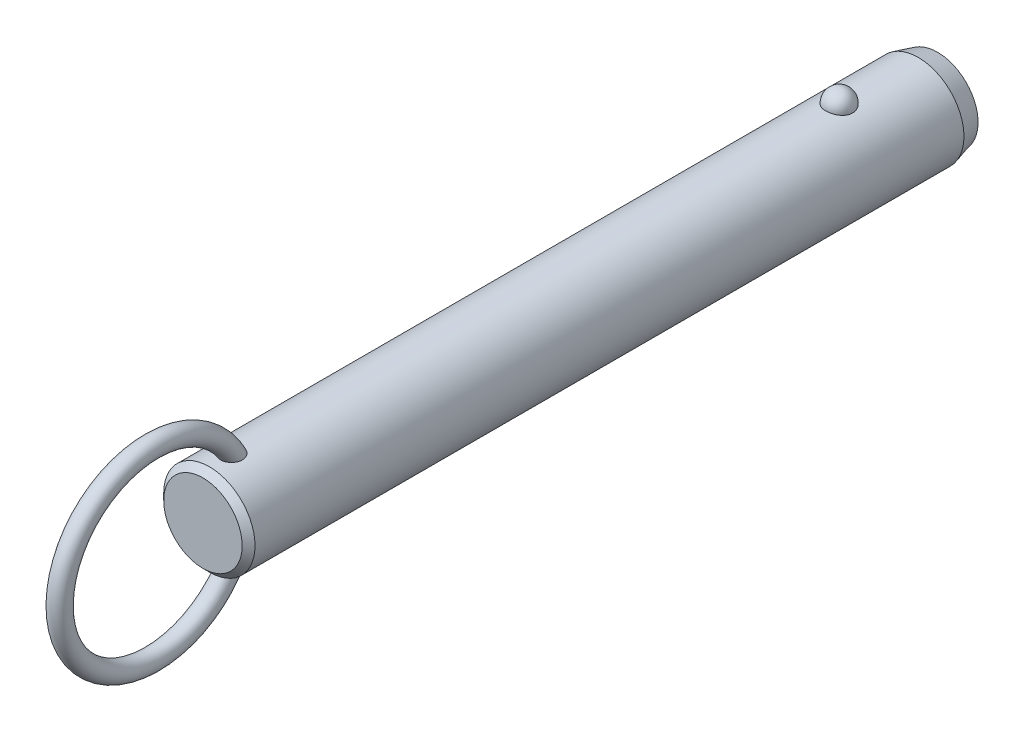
ISO-10303-21;
HEADER;
FILE_DESCRIPTION(('STEP AP214'),'2;1');
FILE_NAME('part.step','',(''),(''),'','','');
FILE_SCHEMA(('AUTOMOTIVE_DESIGN { 1 0 10303 214 1 1 1 1 }'));
ENDSEC;
DATA;
#1=APPLICATION_CONTEXT('core data for automotive mechanical design processes');
#2=APPLICATION_PROTOCOL_DEFINITION('international standard','automotive_design',2000,#1);
#3=PRODUCT_CONTEXT('',#1,'mechanical');
#4=PRODUCT('Part','Part','',(#3));
#5=PRODUCT_RELATED_PRODUCT_CATEGORY('part','',(#4));
#6=PRODUCT_DEFINITION_FORMATION('','',#4);
#7=PRODUCT_DEFINITION_CONTEXT('part definition',#1,'design');
#8=PRODUCT_DEFINITION('design','',#6,#7);
#9=PRODUCT_DEFINITION_SHAPE('','',#8);
#10=(LENGTH_UNIT() NAMED_UNIT(*) SI_UNIT(.MILLI.,.METRE.));
#11=(NAMED_UNIT(*) PLANE_ANGLE_UNIT() SI_UNIT($,.RADIAN.));
#12=(NAMED_UNIT(*) SI_UNIT($,.STERADIAN.) SOLID_ANGLE_UNIT());
#13=UNCERTAINTY_MEASURE_WITH_UNIT(LENGTH_MEASURE(1.E-05),#10,'distance_accuracy_value','');
#14=(GEOMETRIC_REPRESENTATION_CONTEXT(3) GLOBAL_UNCERTAINTY_ASSIGNED_CONTEXT((#13)) GLOBAL_UNIT_ASSIGNED_CONTEXT((#10,
#11,#12)) REPRESENTATION_CONTEXT('',''));
#15=CARTESIAN_POINT('',(0.,0.,0.));
#16=DIRECTION('',(0.,0.,1.));
#17=DIRECTION('',(1.,0.,0.));
#18=AXIS2_PLACEMENT_3D('',#15,#16,#17);
#19=CARTESIAN_POINT('',(0.,0.,88.9));
#20=DIRECTION('',(0.,0.,-1.));
#21=DIRECTION('',(-1.,0.,0.));
#22=AXIS2_PLACEMENT_3D('',#19,#20,#21);
#23=CYLINDRICAL_SURFACE('',#22,7.1);
#24=CARTESIAN_POINT('',(2.0769088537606,6.78943661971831,-2.1));
#25=CARTESIAN_POINT('',(2.07690739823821,6.78943796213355,-1.98268154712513));
#26=CARTESIAN_POINT('',(2.06738130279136,6.79237331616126,-1.86534506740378));
#27=CARTESIAN_POINT('',(2.0295040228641,6.8037853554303,-1.63400788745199));
#28=CARTESIAN_POINT('',(2.00114757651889,6.81226358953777,-1.52000812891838));
#29=CARTESIAN_POINT('',(1.92632025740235,6.83379798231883,-1.29863433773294));
#30=CARTESIAN_POINT('',(1.87985726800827,6.84685214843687,-1.19125744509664));
#31=CARTESIAN_POINT('',(1.76995205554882,6.87608091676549,-0.98604657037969));
#32=CARTESIAN_POINT('',(1.70650980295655,6.8922555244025,-0.88821260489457));
#33=CARTESIAN_POINT('',(1.5638119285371,6.92602930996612,-0.704242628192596));
#34=CARTESIAN_POINT('',(1.4844714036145,6.94363582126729,-0.618173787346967));
#35=CARTESIAN_POINT('',(1.31221746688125,6.97823658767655,-0.460740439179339));
#36=CARTESIAN_POINT('',(1.21930409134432,6.99523084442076,-0.389375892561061));
#37=CARTESIAN_POINT('',(1.02268781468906,7.02666176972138,-0.263547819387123));
#38=CARTESIAN_POINT('',(0.91902009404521,7.04110638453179,-0.209031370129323));
#39=CARTESIAN_POINT('',(0.703548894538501,7.06588726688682,-0.118163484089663));
#40=CARTESIAN_POINT('',(0.591746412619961,7.07622403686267,-0.0818098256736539));
#41=CARTESIAN_POINT('',(0.365557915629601,7.09147068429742,-0.0288711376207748));
#42=CARTESIAN_POINT('',(0.251267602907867,7.09648447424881,-0.0119070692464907));
#43=CARTESIAN_POINT('',(0.0213499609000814,7.10089837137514,0.00304925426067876));
#44=CARTESIAN_POINT('',(-0.0942772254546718,7.10029907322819,0.00104351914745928));
#45=CARTESIAN_POINT('',(-0.321651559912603,7.09360829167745,-0.0216931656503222));
#46=CARTESIAN_POINT('',(-0.433431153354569,7.08760388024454,-0.0421272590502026));
#47=CARTESIAN_POINT('',(-0.651862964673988,7.07086131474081,-0.100729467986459));
#48=CARTESIAN_POINT('',(-0.758515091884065,7.06012307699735,-0.138897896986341));
#49=CARTESIAN_POINT('',(-0.964449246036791,7.03496097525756,-0.232213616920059));
#50=CARTESIAN_POINT('',(-1.06368095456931,7.02051445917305,-0.287465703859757));
#51=CARTESIAN_POINT('',(-1.25145353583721,6.98948740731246,-0.413383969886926));
#52=CARTESIAN_POINT('',(-1.33999321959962,6.97290663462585,-0.48405186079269));
#53=CARTESIAN_POINT('',(-1.50591604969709,6.93898770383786,-0.640594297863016));
#54=CARTESIAN_POINT('',(-1.58302488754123,6.92164094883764,-0.726757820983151));
#55=CARTESIAN_POINT('',(-1.72189320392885,6.8884103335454,-0.91092752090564));
#56=CARTESIAN_POINT('',(-1.78365144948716,6.87252659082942,-1.008934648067));
#57=CARTESIAN_POINT('',(-1.89101272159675,6.84377189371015,-1.21549497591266));
#58=CARTESIAN_POINT('',(-1.93639553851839,6.83094274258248,-1.32416860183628));
#59=CARTESIAN_POINT('',(-2.00874275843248,6.81002070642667,-1.54791500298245));
#60=CARTESIAN_POINT('',(-2.03570774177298,6.80192767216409,-1.66298757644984));
#61=CARTESIAN_POINT('',(-2.07047276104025,6.7914266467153,-1.89571453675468));
#62=CARTESIAN_POINT('',(-2.07835878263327,6.78899315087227,-2.01335491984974));
#63=CARTESIAN_POINT('',(-2.07502083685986,6.79001409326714,-2.24833570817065));
#64=CARTESIAN_POINT('',(-2.06379746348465,6.7934683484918,-2.36567612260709));
#65=CARTESIAN_POINT('',(-2.02263913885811,6.80583442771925,-2.59603194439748));
#66=CARTESIAN_POINT('',(-1.99281127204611,6.81471501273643,-2.70906820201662));
#67=CARTESIAN_POINT('',(-1.91526639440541,6.83691232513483,-2.92836575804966));
#68=CARTESIAN_POINT('',(-1.8675486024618,6.85022924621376,-3.03462676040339));
#69=CARTESIAN_POINT('',(-1.75504492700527,6.87991336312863,-3.23806487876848));
#70=CARTESIAN_POINT('',(-1.69015924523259,6.89629822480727,-3.33518422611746));
#71=CARTESIAN_POINT('',(-1.54505404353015,6.93024852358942,-3.51697105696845));
#72=CARTESIAN_POINT('',(-1.46483385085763,6.94781401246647,-3.60163799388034));
#73=CARTESIAN_POINT('',(-1.29071406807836,6.98225977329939,-3.75654119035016));
#74=CARTESIAN_POINT('',(-1.19675650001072,6.99913673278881,-3.82671308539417));
#75=CARTESIAN_POINT('',(-0.997940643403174,7.03023618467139,-3.9501837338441));
#76=CARTESIAN_POINT('',(-0.89308318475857,7.04445887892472,-4.00348377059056));
#77=CARTESIAN_POINT('',(-0.676902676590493,7.06848365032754,-4.09107242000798));
#78=CARTESIAN_POINT('',(-0.565686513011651,7.0783430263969,-4.12560889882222));
#79=CARTESIAN_POINT('',(-0.338739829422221,7.09282534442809,-4.17575450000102));
#80=CARTESIAN_POINT('',(-0.223009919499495,7.09744899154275,-4.19136617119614));
#81=CARTESIAN_POINT('',(0.00707628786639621,7.10090930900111,-4.20307965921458));
#82=CARTESIAN_POINT('',(0.121410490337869,7.09986531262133,-4.19958377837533));
#83=CARTESIAN_POINT('',(0.347815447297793,7.092380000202,-4.17411564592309));
#84=CARTESIAN_POINT('',(0.459886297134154,7.08593891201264,-4.15214417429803));
#85=CARTESIAN_POINT('',(0.678084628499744,7.06838983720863,-4.09049562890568));
#86=CARTESIAN_POINT('',(0.784237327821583,7.05730369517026,-4.05090137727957));
#87=CARTESIAN_POINT('',(0.988305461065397,7.03163139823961,-3.95511447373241));
#88=CARTESIAN_POINT('',(1.08622031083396,7.01704499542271,-3.89892064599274));
#89=CARTESIAN_POINT('',(1.27284490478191,6.98562668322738,-3.77035541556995));
#90=CARTESIAN_POINT('',(1.36137372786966,6.96876135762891,-3.69772964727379));
#91=CARTESIAN_POINT('',(1.52509486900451,6.93477412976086,-3.53878279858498));
#92=CARTESIAN_POINT('',(1.60028496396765,6.91765218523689,-3.45245943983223));
#93=CARTESIAN_POINT('',(1.73681688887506,6.88465753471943,-3.26658774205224));
#94=CARTESIAN_POINT('',(1.79785966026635,6.86881574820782,-3.16681408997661));
#95=CARTESIAN_POINT('',(1.90265327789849,6.84053157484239,-2.95814408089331));
#96=CARTESIAN_POINT('',(1.94640861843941,6.82808830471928,-2.84925010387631));
#97=CARTESIAN_POINT('',(2.01274378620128,6.80881460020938,-2.63454318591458));
#98=CARTESIAN_POINT('',(2.03676193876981,6.80160856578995,-2.52920574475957));
#99=CARTESIAN_POINT('',(2.06884490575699,6.79191902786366,-2.3159172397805));
#100=CARTESIAN_POINT('',(2.07691019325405,6.78943538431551,-2.20796625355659));
#101=CARTESIAN_POINT('',(2.0769088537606,6.78943661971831,-2.1));
#102=B_SPLINE_CURVE_WITH_KNOTS('',3,(#24,#25,#26,#27,#28,#29,#30,#31,#32,#33,#34,#35,#36,#37,
#38,#39,#40,#41,#42,#43,#44,#45,#46,#47,#48,#49,#50,#51,#52,#53,#54,#55,#56,#57,#58,#59,#60,#61,
#62,#63,#64,#65,#66,#67,#68,#69,#70,#71,#72,#73,#74,#75,#76,#77,#78,#79,#80,#81,#82,#83,#84,#85,
#86,#87,#88,#89,#90,#91,#92,#93,#94,#95,#96,#97,#98,#99,#100,#101),.UNSPECIFIED.,.T.,.F.,(4,2,2,
2,2,2,2,2,2,2,2,2,2,2,2,2,2,2,2,2,2,2,2,2,2,2,2,2,2,2,2,2,2,2,2,2,2,2,4),(0.,0.351568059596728,
0.703234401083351,1.05474780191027,1.40626181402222,1.75970563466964,2.11314851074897,
2.4654696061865,2.81774759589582,3.16301449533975,3.50824481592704,3.84801136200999,
4.18778391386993,4.52968352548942,4.87162112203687,5.22076181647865,5.56993054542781,
5.92363364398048,6.27732559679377,6.62942052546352,6.98150450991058,7.33158042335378,
7.68167162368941,8.03384443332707,8.38603269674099,8.73975272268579,9.09344583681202,
9.44234545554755,9.79119807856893,10.1327344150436,10.4742563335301,10.8141898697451,
11.1541474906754,11.4997793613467,11.8454687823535,12.1979079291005,12.5502553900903,
12.8738073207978,13.1973496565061),.UNSPECIFIED.);
#103=CARTESIAN_POINT('',(2.0769088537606,6.78943661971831,-2.1));
#104=VERTEX_POINT('',#103);
#105=EDGE_CURVE('E41',#104,#104,#102,.T.);
#106=ORIENTED_EDGE('',*,*,#105,.T.);
#107=EDGE_LOOP('',(#106));
#108=FACE_BOUND('',#107,.T.);
#109=CARTESIAN_POINT('',(0.,0.,95.82));
#110=DIRECTION('',(0.,0.,1.));
#111=DIRECTION('',(1.,0.,0.));
#112=AXIS2_PLACEMENT_3D('',#109,#110,#111);
#113=CIRCLE('',#112,7.1);
#114=CARTESIAN_POINT('',(7.1,0.,95.82));
#115=VERTEX_POINT('',#114);
#116=EDGE_CURVE('E10',#115,#115,#113,.F.);
#117=ORIENTED_EDGE('',*,*,#116,.T.);
#118=EDGE_LOOP('',(#117));
#119=FACE_BOUND('',#118,.T.);
#120=CARTESIAN_POINT('',(-0.429539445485,-7.08699541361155,90.6429212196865));
#121=CARTESIAN_POINT('',(-0.508331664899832,-7.08221999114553,90.6668764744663));
#122=CARTESIAN_POINT('',(-0.58503984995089,-7.07624016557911,90.6974570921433));
#123=CARTESIAN_POINT('',(-0.732082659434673,-7.06254296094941,90.7710242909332));
#124=CARTESIAN_POINT('',(-0.802417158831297,-7.05482554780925,90.8140111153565));
#125=CARTESIAN_POINT('',(-0.934722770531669,-7.03851844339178,90.9111135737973));
#126=CARTESIAN_POINT('',(-0.99670020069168,-7.02992941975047,90.9652207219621));
#127=CARTESIAN_POINT('',(-1.11079942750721,-7.01280697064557,91.0829676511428));
#128=CARTESIAN_POINT('',(-1.16292136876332,-7.00427354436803,91.1466072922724));
#129=CARTESIAN_POINT('',(-1.25705660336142,-6.98799959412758,91.2826870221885));
#130=CARTESIAN_POINT('',(-1.29888032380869,-6.98027525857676,91.3552598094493));
#131=CARTESIAN_POINT('',(-1.37069920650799,-6.96652886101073,91.5061686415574));
#132=CARTESIAN_POINT('',(-1.40069157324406,-6.96050720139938,91.5845060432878));
#133=CARTESIAN_POINT('',(-1.45043507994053,-6.95031881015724,91.7501903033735));
#134=CARTESIAN_POINT('',(-1.46937115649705,-6.94630231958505,91.8377897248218));
#135=CARTESIAN_POINT('',(-1.49424917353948,-6.94099239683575,92.0148714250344));
#136=CARTESIAN_POINT('',(-1.50018601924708,-6.93970003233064,92.1043544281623));
#137=CARTESIAN_POINT('',(-1.49978214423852,-6.93978815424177,92.2940607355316));
#138=CARTESIAN_POINT('',(-1.49187639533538,-6.94150934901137,92.394279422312));
#139=CARTESIAN_POINT('',(-1.46177925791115,-6.94790814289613,92.5924798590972));
#140=CARTESIAN_POINT('',(-1.43957541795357,-6.95258831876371,92.690459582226));
#141=CARTESIAN_POINT('',(-1.37783293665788,-6.96510647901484,92.8953629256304));
#142=CARTESIAN_POINT('',(-1.33634073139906,-6.97328848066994,93.0016801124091));
#143=CARTESIAN_POINT('',(-1.23686994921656,-6.99161706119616,93.2061777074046));
#144=CARTESIAN_POINT('',(-1.17889192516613,-7.00176357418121,93.3043583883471));
#145=CARTESIAN_POINT('',(-1.0587512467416,-7.02082898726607,93.4723743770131));
#146=CARTESIAN_POINT('',(-0.999247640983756,-7.02963746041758,93.5441230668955));
#147=CARTESIAN_POINT('',(-0.869494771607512,-7.04686074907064,93.6771959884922));
#148=CARTESIAN_POINT('',(-0.799263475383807,-7.05527619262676,93.7385372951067));
#149=CARTESIAN_POINT('',(-0.665408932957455,-7.06899457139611,93.8351316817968));
#150=CARTESIAN_POINT('',(-0.603817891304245,-7.07457275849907,93.8731512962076));
#151=CARTESIAN_POINT('',(-0.47517283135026,-7.08437420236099,93.9387581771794));
#152=CARTESIAN_POINT('',(-0.408123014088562,-7.08859848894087,93.9663533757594));
#153=CARTESIAN_POINT('',(-0.269431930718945,-7.09522749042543,94.0092569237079));
#154=CARTESIAN_POINT('',(-0.197757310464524,-7.09761688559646,94.0244618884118));
#155=CARTESIAN_POINT('',(-0.0527849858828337,-7.10017268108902,94.0407168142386));
#156=CARTESIAN_POINT('',(0.0205115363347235,-7.10034065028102,94.0417767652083));
#157=CARTESIAN_POINT('',(0.156426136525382,-7.09855986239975,94.0304619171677));
#158=CARTESIAN_POINT('',(0.219199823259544,-7.09688191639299,94.0198060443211));
#159=CARTESIAN_POINT('',(0.342134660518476,-7.09201880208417,93.9885379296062));
#160=CARTESIAN_POINT('',(0.402295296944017,-7.08883333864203,93.9679237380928));
#161=CARTESIAN_POINT('',(0.520687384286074,-7.08113868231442,93.9172125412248));
#162=CARTESIAN_POINT('',(0.578791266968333,-7.07658958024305,93.8868272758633));
#163=CARTESIAN_POINT('',(0.690173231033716,-7.06659708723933,93.8183678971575));
#164=CARTESIAN_POINT('',(0.743447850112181,-7.061153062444,93.7802883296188));
#165=CARTESIAN_POINT('',(0.870947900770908,-7.04680292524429,93.6765929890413));
#166=CARTESIAN_POINT('',(0.941828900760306,-7.0375580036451,93.6068972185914));
#167=CARTESIAN_POINT('',(1.07136606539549,-7.01900793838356,93.4569450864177));
#168=CARTESIAN_POINT('',(1.13000013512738,-7.00970271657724,93.3766700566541));
#169=CARTESIAN_POINT('',(1.23579584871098,-6.99183327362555,93.2068997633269));
#170=CARTESIAN_POINT('',(1.2827427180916,-6.98328455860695,93.1172696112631));
#171=CARTESIAN_POINT('',(1.36351442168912,-6.96796352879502,92.9321763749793));
#172=CARTESIAN_POINT('',(1.39733971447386,-6.96119115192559,92.8367134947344));
#173=CARTESIAN_POINT('',(1.45579181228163,-6.94922464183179,92.6253092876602));
#174=CARTESIAN_POINT('',(1.47790145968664,-6.94449000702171,92.508631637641));
#175=CARTESIAN_POINT('',(1.50168752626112,-6.93938731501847,92.2730153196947));
#176=CARTESIAN_POINT('',(1.50336085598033,-6.93901991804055,92.1540763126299));
#177=CARTESIAN_POINT('',(1.48486516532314,-6.9430010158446,91.9236079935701));
#178=CARTESIAN_POINT('',(1.46573441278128,-6.9471253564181,91.8119958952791));
#179=CARTESIAN_POINT('',(1.40606892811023,-6.95944667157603,91.5948868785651));
#180=CARTESIAN_POINT('',(1.36556446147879,-6.96763788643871,91.4893815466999));
#181=CARTESIAN_POINT('',(1.27082700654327,-6.98548038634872,91.3042879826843));
#182=CARTESIAN_POINT('',(1.21949810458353,-6.99473841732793,91.2231719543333));
#183=CARTESIAN_POINT('',(1.10242050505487,-7.01414069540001,91.0722278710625));
#184=CARTESIAN_POINT('',(1.03668119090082,-7.02428436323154,91.0023925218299));
#185=CARTESIAN_POINT('',(0.900559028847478,-7.04295285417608,90.8835735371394));
#186=CARTESIAN_POINT('',(0.83142884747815,-7.05153466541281,90.8331573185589));
#187=CARTESIAN_POINT('',(0.68529187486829,-7.06723150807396,90.7451429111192));
#188=CARTESIAN_POINT('',(0.608287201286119,-7.0743469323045,90.7075412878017));
#189=CARTESIAN_POINT('',(0.451878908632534,-7.08602232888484,90.6474915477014));
#190=CARTESIAN_POINT('',(0.372686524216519,-7.09067127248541,90.6245088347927));
#191=CARTESIAN_POINT('',(0.211477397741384,-7.09730788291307,90.5920357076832));
#192=CARTESIAN_POINT('',(0.129460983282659,-7.09929585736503,90.5825437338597));
#193=CARTESIAN_POINT('',(-0.0332905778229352,-7.10037858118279,90.5773517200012));
#194=CARTESIAN_POINT('',(-0.11401636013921,-7.09953334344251,90.5813656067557));
#195=CARTESIAN_POINT('',(-0.273670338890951,-7.09517338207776,90.6024540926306));
#196=CARTESIAN_POINT('',(-0.352598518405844,-7.09165863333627,90.6195288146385));
#197=CARTESIAN_POINT('',(-0.429539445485,-7.08699541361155,90.6429212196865));
#198=B_SPLINE_CURVE_WITH_KNOTS('',3,(#120,#121,#122,#123,#124,#125,#126,#127,#128,#129,#130,
#131,#132,#133,#134,#135,#136,#137,#138,#139,#140,#141,#142,#143,#144,#145,#146,#147,#148,#149,
#150,#151,#152,#153,#154,#155,#156,#157,#158,#159,#160,#161,#162,#163,#164,#165,#166,#167,#168,
#169,#170,#171,#172,#173,#174,#175,#176,#177,#178,#179,#180,#181,#182,#183,#184,#185,#186,#187,
#188,#189,#190,#191,#192,#193,#194,#195,#196,#197),.UNSPECIFIED.,.T.,.F.,(4,2,2,2,2,2,2,2,2,2,2,
2,2,2,2,2,2,2,2,2,2,2,2,2,2,2,2,2,2,2,2,2,2,2,2,2,2,2,4),(0.,0.247183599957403,
0.494372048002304,0.741372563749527,0.988369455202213,1.23962059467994,1.49093106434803,
1.75897818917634,2.02713035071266,2.32758265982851,2.62829697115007,2.97008736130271,
3.31186629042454,3.59175319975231,3.87117637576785,4.08813841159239,4.30493502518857,
4.52352259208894,4.74195577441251,4.9321532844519,5.12238804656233,5.31884850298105,
5.51544871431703,5.81332317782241,6.11173048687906,6.4152726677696,6.71880423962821,
7.07358156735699,7.42841252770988,7.76631485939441,8.10373999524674,8.3914224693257,
8.67891817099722,8.93560332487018,9.19221962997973,9.43881106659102,9.68537399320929,
9.92674752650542,10.1681233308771),.UNSPECIFIED.);
#199=CARTESIAN_POINT('',(-0.429539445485,-7.08699541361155,90.6429212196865));
#200=VERTEX_POINT('',#199);
#201=EDGE_CURVE('E60',#200,#200,#198,.T.);
#202=ORIENTED_EDGE('',*,*,#201,.T.);
#203=EDGE_LOOP('',(#202));
#204=FACE_BOUND('',#203,.T.);
#205=CARTESIAN_POINT('',(-0.429539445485,7.08699541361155,90.6429212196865));
#206=CARTESIAN_POINT('',(-0.351665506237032,7.09171429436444,90.6192469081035));
#207=CARTESIAN_POINT('',(-0.271733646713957,7.09525896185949,90.6020369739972));
#208=CARTESIAN_POINT('',(-0.110026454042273,7.09960839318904,90.5810059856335));
#209=CARTESIAN_POINT('',(-0.028250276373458,7.10041187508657,90.577191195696));
#210=CARTESIAN_POINT('',(0.134782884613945,7.09918849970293,90.583059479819));
#211=CARTESIAN_POINT('',(0.21603995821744,7.09716214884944,90.5927401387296));
#212=CARTESIAN_POINT('',(0.375730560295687,7.09050177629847,90.6253471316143));
#213=CARTESIAN_POINT('',(0.454164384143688,7.08586802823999,90.6482720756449));
#214=CARTESIAN_POINT('',(0.60602533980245,7.07449911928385,90.7067718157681));
#215=CARTESIAN_POINT('',(0.679451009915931,7.06776334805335,90.7423502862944));
#216=CARTESIAN_POINT('',(0.819234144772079,7.05292866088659,90.8251753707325));
#217=CARTESIAN_POINT('',(0.88559181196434,7.04482978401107,90.8724216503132));
#218=CARTESIAN_POINT('',(1.00993211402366,7.02808709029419,90.9775902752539));
#219=CARTESIAN_POINT('',(1.06785399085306,7.01943990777,91.035583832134));
#220=CARTESIAN_POINT('',(1.17342527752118,7.00256662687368,91.1603013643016));
#221=CARTESIAN_POINT('',(1.22107408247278,6.99434055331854,91.2270258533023));
#222=CARTESIAN_POINT('',(1.30652927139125,6.97889183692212,91.3693622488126));
#223=CARTESIAN_POINT('',(1.34399711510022,6.97170674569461,91.4451808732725));
#224=CARTESIAN_POINT('',(1.40682616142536,6.95930080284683,91.6018100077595));
#225=CARTESIAN_POINT('',(1.43218374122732,6.95408053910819,91.6826220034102));
#226=CARTESIAN_POINT('',(1.47246409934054,6.94566853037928,91.8535314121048));
#227=CARTESIAN_POINT('',(1.48642590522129,6.9426653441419,91.9438630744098));
#228=CARTESIAN_POINT('',(1.5011410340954,6.93949744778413,92.125619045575));
#229=CARTESIAN_POINT('',(1.50188917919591,6.93933385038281,92.2170437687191));
#230=CARTESIAN_POINT('',(1.49030464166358,6.94183245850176,92.4108438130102));
#231=CARTESIAN_POINT('',(1.47627413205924,6.94486147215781,92.513112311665));
#232=CARTESIAN_POINT('',(1.43356351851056,6.95380194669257,92.7144719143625));
#233=CARTESIAN_POINT('',(1.4048676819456,6.95971650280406,92.8135594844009));
#234=CARTESIAN_POINT('',(1.32908750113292,6.97461208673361,93.0189087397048));
#235=CARTESIAN_POINT('',(1.28011435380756,6.98388945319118,93.1244566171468));
#236=CARTESIAN_POINT('',(1.16520357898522,7.00397743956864,93.3257604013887));
#237=CARTESIAN_POINT('',(1.09927694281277,7.01478706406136,93.4215225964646));
#238=CARTESIAN_POINT('',(0.969361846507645,7.03373936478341,93.5767565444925));
#239=CARTESIAN_POINT('',(0.909042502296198,7.04187023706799,93.6393032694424));
#240=CARTESIAN_POINT('',(0.77917855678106,7.0574173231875,93.7540535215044));
#241=CARTESIAN_POINT('',(0.70964977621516,7.06483472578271,93.8062744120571));
#242=CARTESIAN_POINT('',(0.576854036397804,7.0767751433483,93.8881138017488));
#243=CARTESIAN_POINT('',(0.515118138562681,7.08158033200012,93.9201641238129));
#244=CARTESIAN_POINT('',(0.387127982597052,7.08972701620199,93.9737656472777));
#245=CARTESIAN_POINT('',(0.320877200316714,7.09306962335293,93.9953248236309));
#246=CARTESIAN_POINT('',(0.185041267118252,7.09791507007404,94.0264005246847));
#247=CARTESIAN_POINT('',(0.115437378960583,7.09940591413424,94.0358385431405));
#248=CARTESIAN_POINT('',(-0.0243157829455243,7.10030171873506,94.0415226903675));
#249=CARTESIAN_POINT('',(-0.0944648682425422,7.0997073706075,94.0377731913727));
#250=CARTESIAN_POINT('',(-0.225713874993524,7.09668414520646,94.0185081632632));
#251=CARTESIAN_POINT('',(-0.287006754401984,7.09444865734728,94.0042323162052));
#252=CARTESIAN_POINT('',(-0.40655537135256,7.08860360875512,93.9663685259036));
#253=CARTESIAN_POINT('',(-0.46480981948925,7.08499346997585,93.9427766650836));
#254=CARTESIAN_POINT('',(-0.594955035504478,7.07541654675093,93.8789232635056));
#255=CARTESIAN_POINT('',(-0.665389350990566,7.06906574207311,93.835753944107));
#256=CARTESIAN_POINT('',(-0.798242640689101,7.05530261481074,93.738587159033));
#257=CARTESIAN_POINT('',(-0.860645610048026,7.0478882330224,93.6845686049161));
#258=CARTESIAN_POINT('',(-0.994249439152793,7.03045217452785,93.5509965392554));
#259=CARTESIAN_POINT('',(-1.06260129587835,7.02030745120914,93.4686143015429));
#260=CARTESIAN_POINT('',(-1.18502045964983,7.00068382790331,93.293843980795));
#261=CARTESIAN_POINT('',(-1.23907684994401,6.99120544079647,93.201448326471));
#262=CARTESIAN_POINT('',(-1.33335589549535,6.97384343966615,93.0080085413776));
#263=CARTESIAN_POINT('',(-1.3733613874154,6.96598557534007,92.9068564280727));
#264=CARTESIAN_POINT('',(-1.43770677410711,6.9529905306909,92.6995046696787));
#265=CARTESIAN_POINT('',(-1.46204473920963,6.94785368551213,92.59330440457));
#266=CARTESIAN_POINT('',(-1.49537533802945,6.94076296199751,92.3682317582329));
#267=CARTESIAN_POINT('',(-1.50273564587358,6.93914842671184,92.2490975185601));
#268=CARTESIAN_POINT('',(-1.4954555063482,6.94072368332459,92.0114703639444));
#269=CARTESIAN_POINT('',(-1.48082914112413,6.94391040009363,91.8929770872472));
#270=CARTESIAN_POINT('',(-1.43076401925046,6.95438579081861,91.6734325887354));
#271=CARTESIAN_POINT('',(-1.39762227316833,6.96121852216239,91.5718413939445));
#272=CARTESIAN_POINT('',(-1.31211274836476,6.97783941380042,91.3773513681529));
#273=CARTESIAN_POINT('',(-1.2597660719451,6.98762432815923,91.2844431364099));
#274=CARTESIAN_POINT('',(-1.14583073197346,7.00713153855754,91.1241601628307));
#275=CARTESIAN_POINT('',(-1.0866594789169,7.01665982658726,91.0550351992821));
#276=CARTESIAN_POINT('',(-0.956606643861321,7.03556646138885,90.9288786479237));
#277=CARTESIAN_POINT('',(-0.88573712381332,7.04494495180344,90.8718347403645));
#278=CARTESIAN_POINT('',(-0.75155804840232,7.06035735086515,90.7831004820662));
#279=CARTESIAN_POINT('',(-0.690120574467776,7.0666695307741,90.7485932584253));
#280=CARTESIAN_POINT('',(-0.562815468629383,7.07794609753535,90.6887507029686));
#281=CARTESIAN_POINT('',(-0.496948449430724,7.08291067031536,90.6634141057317));
#282=CARTESIAN_POINT('',(-0.429539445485,7.08699541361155,90.6429212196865));
#283=B_SPLINE_CURVE_WITH_KNOTS('',3,(#205,#206,#207,#208,#209,#210,#211,#212,#213,#214,#215,
#216,#217,#218,#219,#220,#221,#222,#223,#224,#225,#226,#227,#228,#229,#230,#231,#232,#233,#234,
#235,#236,#237,#238,#239,#240,#241,#242,#243,#244,#245,#246,#247,#248,#249,#250,#251,#252,#253,
#254,#255,#256,#257,#258,#259,#260,#261,#262,#263,#264,#265,#266,#267,#268,#269,#270,#271,#272,
#273,#274,#275,#276,#277,#278,#279,#280,#281,#282),.UNSPECIFIED.,.T.,.F.,(4,2,2,2,2,2,2,2,2,2,2,
2,2,2,2,2,2,2,2,2,2,2,2,2,2,2,2,2,2,2,2,2,2,2,2,2,2,2,4),(0.,0.244335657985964,
0.488785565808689,0.733191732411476,0.977572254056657,1.22202379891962,1.46646834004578,
1.71259457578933,1.95873529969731,2.21226768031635,2.46587585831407,2.7391381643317,
3.01250754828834,3.32109936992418,3.63002293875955,3.97863512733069,4.32702187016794,
4.5879394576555,4.84841449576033,5.05676704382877,5.26496096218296,5.47449661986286,
5.68396281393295,5.87205447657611,6.06022532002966,6.30743751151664,6.55513496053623,
6.87602468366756,7.19715875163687,7.52305774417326,7.84899686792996,8.20516155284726,
8.56109821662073,8.8804008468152,9.19935367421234,9.47236282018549,9.74509220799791,
9.9566225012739,10.1681235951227),.UNSPECIFIED.);
#284=CARTESIAN_POINT('',(-0.429539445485,7.08699541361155,90.6429212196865));
#285=VERTEX_POINT('',#284);
#286=EDGE_CURVE('E68',#285,#285,#283,.T.);
#287=ORIENTED_EDGE('',*,*,#286,.T.);
#288=EDGE_LOOP('',(#287));
#289=FACE_BOUND('',#288,.T.);
#290=CARTESIAN_POINT('',(0.,0.,-14.3999999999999));
#291=DIRECTION('',(0.,0.,-1.));
#292=DIRECTION('',(-1.,0.,0.));
#293=AXIS2_PLACEMENT_3D('',#290,#291,#292);
#294=CIRCLE('',#293,7.1);
#295=CARTESIAN_POINT('',(-7.1,0.,-14.3999999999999));
#296=VERTEX_POINT('',#295);
#297=EDGE_CURVE('E57',#296,#296,#294,.F.);
#298=ORIENTED_EDGE('',*,*,#297,.T.);
#299=EDGE_LOOP('',(#298));
#300=FACE_BOUND('',#299,.T.);
#301=ADVANCED_FACE('F37',(#108,#119,#204,#289,#300),#23,.T.);
#302=CARTESIAN_POINT('',(0.,0.,-17.4));
#303=DIRECTION('',(0.,0.,-1.));
#304=DIRECTION('',(-1.,0.,0.));
#305=AXIS2_PLACEMENT_3D('',#302,#303,#304);
#306=PLANE('',#305);
#307=CARTESIAN_POINT('',(0.,0.,-17.4));
#308=DIRECTION('',(0.,0.,-1.));
#309=DIRECTION('',(-1.,0.,0.));
#310=AXIS2_PLACEMENT_3D('',#307,#308,#309);
#311=CIRCLE('',#310,6.29615242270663);
#312=CARTESIAN_POINT('',(-6.29615242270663,0.,-17.4));
#313=VERTEX_POINT('',#312);
#314=EDGE_CURVE('E67',#313,#313,#311,.T.);
#315=ORIENTED_EDGE('',*,*,#314,.T.);
#316=EDGE_LOOP('',(#315));
#317=FACE_BOUND('',#316,.T.);
#318=ADVANCED_FACE('F86',(#317),#306,.T.);
#319=CARTESIAN_POINT('',(0.,0.,-17.4));
#320=DIRECTION('',(0.,0.,1.));
#321=DIRECTION('',(1.,0.,0.));
#322=AXIS2_PLACEMENT_3D('',#319,#320,#321);
#323=CONICAL_SURFACE('',#322,6.29615242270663,0.261799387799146);
#324=ORIENTED_EDGE('',*,*,#297,.F.);
#325=EDGE_LOOP('',(#324));
#326=FACE_BOUND('',#325,.T.);
#327=ORIENTED_EDGE('',*,*,#314,.F.);
#328=EDGE_LOOP('',(#327));
#329=FACE_BOUND('',#328,.T.);
#330=ADVANCED_FACE('F84',(#326,#329),#323,.T.);
#331=CARTESIAN_POINT('',(0.,0.,96.82));
#332=DIRECTION('',(0.,0.,1.));
#333=DIRECTION('',(1.,0.,0.));
#334=AXIS2_PLACEMENT_3D('',#331,#332,#333);
#335=PLANE('',#334);
#336=CARTESIAN_POINT('',(0.,0.,96.82));
#337=DIRECTION('',(0.,0.,1.));
#338=DIRECTION('',(1.,0.,0.));
#339=AXIS2_PLACEMENT_3D('',#336,#337,#338);
#340=CIRCLE('',#339,6.09999999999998);
#341=CARTESIAN_POINT('',(6.09999999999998,0.,96.82));
#342=VERTEX_POINT('',#341);
#343=EDGE_CURVE('E50',#342,#342,#340,.T.);
#344=ORIENTED_EDGE('',*,*,#343,.T.);
#345=EDGE_LOOP('',(#344));
#346=FACE_BOUND('',#345,.T.);
#347=ADVANCED_FACE('F78',(#346),#335,.T.);
#348=CARTESIAN_POINT('',(0.,0.,104.75));
#349=DIRECTION('',(1.,0.,0.));
#350=DIRECTION('',(0.,0.,-1.));
#351=AXIS2_PLACEMENT_3D('',#348,#349,#350);
#352=TOROIDAL_SURFACE('',#351,14.35,1.5);
#353=ORIENTED_EDGE('',*,*,#286,.F.);
#354=EDGE_LOOP('',(#353));
#355=FACE_BOUND('',#354,.T.);
#356=ORIENTED_EDGE('',*,*,#201,.F.);
#357=EDGE_LOOP('',(#356));
#358=FACE_BOUND('',#357,.T.);
#359=ADVANCED_FACE('F74',(#355,#358),#352,.T.);
#360=CARTESIAN_POINT('',(0.,0.,96.82));
#361=DIRECTION('',(0.,0.,-1.));
#362=DIRECTION('',(-1.,0.,0.));
#363=AXIS2_PLACEMENT_3D('',#360,#361,#362);
#364=CONICAL_SURFACE('',#363,6.09999999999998,0.785398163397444);
#365=ORIENTED_EDGE('',*,*,#116,.F.);
#366=EDGE_LOOP('',(#365));
#367=FACE_BOUND('',#366,.T.);
#368=ORIENTED_EDGE('',*,*,#343,.F.);
#369=EDGE_LOOP('',(#368));
#370=FACE_BOUND('',#369,.T.);
#371=ADVANCED_FACE('F39',(#367,#370),#364,.T.);
#372=CARTESIAN_POINT('',(0.,7.1,-2.1));
#373=DIRECTION('',(0.,1.,0.));
#374=DIRECTION('',(0.,0.,1.));
#375=AXIS2_PLACEMENT_3D('',#372,#373,#374);
#376=SPHERICAL_SURFACE('',#375,2.10000000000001);
#377=ORIENTED_EDGE('',*,*,#105,.F.);
#378=EDGE_LOOP('',(#377));
#379=FACE_BOUND('',#378,.T.);
#380=ADVANCED_FACE('F80',(#379),#376,.T.);
#381=CLOSED_SHELL('',(#301,#318,#330,#347,#359,#371,#380));
#382=MANIFOLD_SOLID_BREP('B2',#381);
#383=ADVANCED_BREP_SHAPE_REPRESENTATION('',(#18,#382),#14);
#384=SHAPE_DEFINITION_REPRESENTATION(#9,#383);
ENDSEC;
END-ISO-10303-21;
